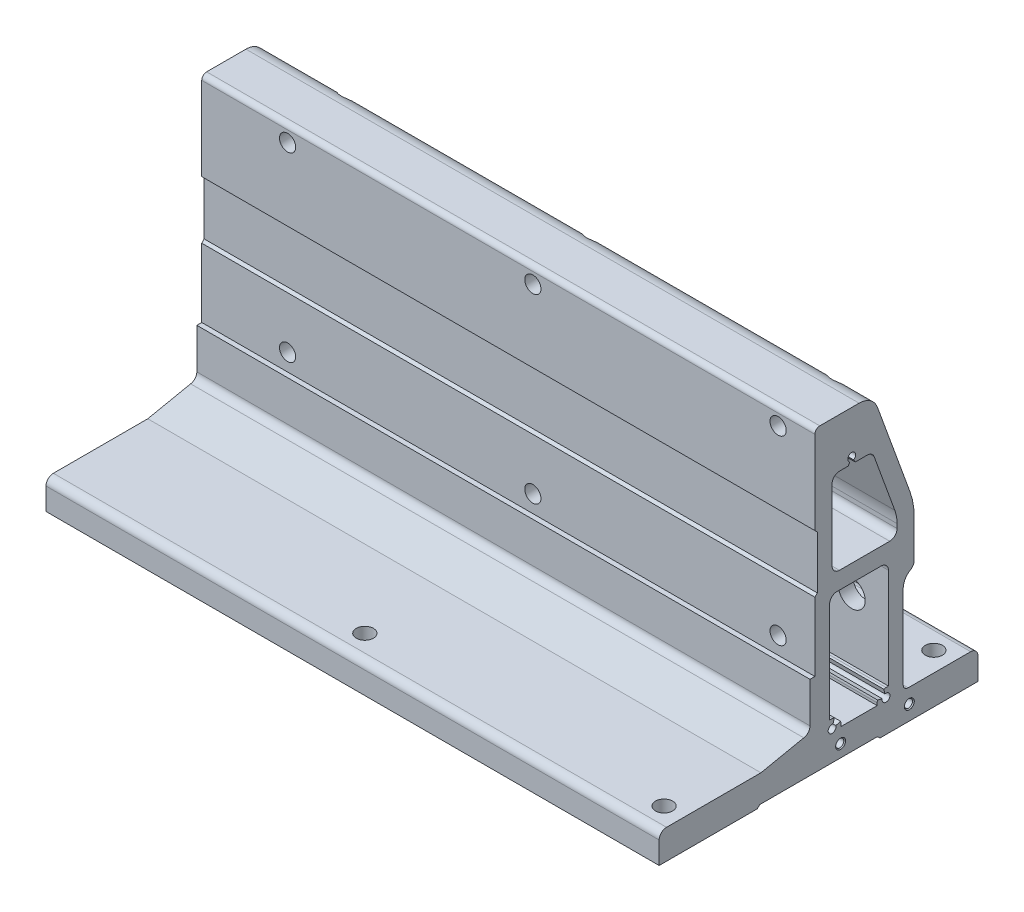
from build123d import *

# Parameters (mm, degrees)
EXTRUDE_1_DEPTH              = 125
HOLE_WIZARD_M6_1_D           = 6.6
HOLE_WIZARD_M6_1_CBORE_D     = 11
HOLE_WIZARD_M6_1_CBORE_DEPTH = 34.5
PATTERN_LINEAR_1_COUNT       = 3
PATTERN_LINEAR_1_PITCH       = 100
HOLE_WIZARD_M4_1_D           = 3.3
HOLE_WIZARD_M4_1_DEPTH       = 10
HOLE_WIZARD_M4_1_CSINK_D     = 4.05
HOLE_WIZARD_M4_1_CSINK_ANGLE = 90
HOLE_WIZARD_M4_1_TIP         = 0.991420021
F_5_0MM_1_D                  = 5
F_5_0MM_1_DEPTH              = 10
F_5_0MM_1_TIP                = 1.502151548
HOLE_WIZARD_7_0_7_1_D        = 7


with BuildPart() as part:
    # Sketch 1 → Extrude 1 (new, symmetric)
    with BuildSketch(Plane(origin=(0, 0, 0), x_dir=(0, 0, -1), z_dir=(1, 0, 0))):
        with BuildLine():
            Line((16.514163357, 121.5), (0.5, 121.5))
            ThreePointArc((0.5, 121.5), (-0.914213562, 120.914213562), (-1.5, 119.5))
            Line((-1.5, 119.5), (-1.5, 85.5))
            Line((-1.5, 85.5), (-0.5, 84.5))
            Line((-0.5, 84.5), (-0.5, 63))
            Line((-0.5, 63), (-1.5, 62))
            Line((-1.5, 62), (-1.5, 34))
            Line((-1.5, 34), (-3.5, 34))
            Line((-3.5, 34), (-3.5, 17.566096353))
            ThreePointArc((-3.5, 17.566096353), (-4.220229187, 15.616059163), (-6.035096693, 14.602337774))
            Line((-6.035096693, 14.602337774), (-23.5, 11))
            Line((-23.5, 11), (-62, 11))
            ThreePointArc((-62, 11), (-64.121320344, 10.121320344), (-65, 8))
            Line((-65, 8), (-65, -1))
            Line((-65, -1), (-25, -1))
            Line((-25, -1), (-24, 0))
            Line((-24, 0), (24, 0))
            Line((24, 0), (25, -1))
            Line((25, -1), (65, -1))
            Line((65, -1), (65, 8))
            ThreePointArc((65, 8), (64.121320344, 10.121320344), (62, 11))
            Line((62, 11), (36.5, 11))
            ThreePointArc((36.5, 11), (35.085786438, 11.585786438), (34.5, 13))
            Line((34.5, 13), (34.5, 47))
            ThreePointArc((34.5, 47), (35.303847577, 50), (37.5, 52.196152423))
            ThreePointArc((37.5, 52.196152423), (38.598076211, 53.294228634), (39, 54.794228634))
            Line((39, 54.794228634), (39, 69.821297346))
            ThreePointArc((39, 69.821297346), (38.54423259, 75.030742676), (37.190778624, 80.081901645))
            Line((37.190778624, 80.081901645), (24.031704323, 116.236161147))
            ThreePointArc((24.031704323, 116.236161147), (21.102774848, 120.053216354), (16.514163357, 121.5))
        make_face()
        with BuildLine():
            Line((25.5, 59.5), (7.5, 59.5))
            ThreePointArc((7.5, 59.5), (5.378679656, 58.621320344), (4.5, 56.5))
            Line((4.5, 56.5), (4.5, 15.6))
            Line((4.5, 15.6), (5.5, 15.6))
            ThreePointArc((5.5, 15.6), (5.969894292, 15.569201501), (6.431748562, 15.477332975))
            Line((6.431748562, 15.477332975), (5.914110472, 13.545481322))
            ThreePointArc((5.914110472, 13.545481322), (4.36862915, 10.86862915), (7.045481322, 12.414110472))
            Line((7.045481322, 12.414110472), (8.977332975, 12.931748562))
            ThreePointArc((8.977332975, 12.931748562), (9.069201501, 12.469894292), (9.1, 12))
            Line((9.1, 12), (9.1, 11))
            Line((9.1, 11), (23.9, 11))
            Line((23.9, 11), (23.9, 12))
            ThreePointArc((23.9, 12), (23.930798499, 12.469894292), (24.022667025, 12.931748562))
            Line((24.022667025, 12.931748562), (25.954518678, 12.414110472))
            ThreePointArc((25.954518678, 12.414110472), (28.63137085, 10.86862915), (27.085889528, 13.545481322))
            Line((27.085889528, 13.545481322), (26.568251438, 15.477332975))
            ThreePointArc((26.568251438, 15.477332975), (27.030105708, 15.569201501), (27.5, 15.6))
            Line((27.5, 15.6), (28.5, 15.6))
            Line((28.5, 15.6), (28.5, 56.5))
            ThreePointArc((28.5, 56.5), (27.621320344, 58.621320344), (25.5, 59.5))
        make_face(mode=Mode.SUBTRACT)
        with BuildLine():
            Line((12.7, 102.614356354), (12.056626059, 101.5))
            Line((12.056626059, 101.5), (8.5, 101.5))
            ThreePointArc((8.5, 101.5), (6.378679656, 100.621320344), (5.5, 98.5))
            Line((5.5, 98.5), (5.5, 69.5))
            ThreePointArc((5.5, 69.5), (6.378679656, 67.378679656), (8.5, 66.5))
            Line((8.5, 66.5), (29, 66.5))
            ThreePointArc((29, 66.5), (31.121320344, 67.378679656), (32, 69.5))
            Line((32, 69.5), (32, 71.231913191))
            ThreePointArc((32, 71.231913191), (31.772116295, 73.836635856), (31.095389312, 76.362215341))
            Line((31.095389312, 76.362215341), (22.664439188, 99.52606043))
            ThreePointArc((22.664439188, 99.52606043), (21.566090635, 100.957456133), (19.845361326, 101.5))
            Line((19.845361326, 101.5), (14.943373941, 101.5))
            Line((14.943373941, 101.5), (14.3, 102.614356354))
            ThreePointArc((14.3, 102.614356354), (13.5, 105.599997), (12.7, 102.614356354))
        make_face(mode=Mode.SUBTRACT)
    extrude(amount=EXTRUDE_1_DEPTH, both=True)

    # Hole Wizard M6 _ _ _ _ _1 (through all)
    with Locations(Plane(origin=(0, 0, -39), x_dir=(-1, 0, 0), z_dir=(0, 0, -1))):
        with Locations((-110, 115), (-110, 41)):
            hole_wizard_m6_1 = CounterBoreHole(HOLE_WIZARD_M6_1_D / 2, HOLE_WIZARD_M6_1_CBORE_D / 2, HOLE_WIZARD_M6_1_CBORE_DEPTH)

    # Pattern Linear 1: Hole Wizard M6 _ _ _ _ _1 ×3
    with Locations(*[(-i * PATTERN_LINEAR_1_PITCH, 0, 0) for i in range(1, PATTERN_LINEAR_1_COUNT)]):
        add(hole_wizard_m6_1, mode=Mode.SUBTRACT)

    # Hole Wizard M4 _ _1
    with Locations(Plane(origin=(125, 0, 0), x_dir=(0, 0, -1), z_dir=(1, 0, 0))):
        with Locations((37, 5), (9, 5)):
            CounterSinkHole(HOLE_WIZARD_M4_1_D / 2, HOLE_WIZARD_M4_1_CSINK_D / 2, depth=HOLE_WIZARD_M4_1_DEPTH, counter_sink_angle=HOLE_WIZARD_M4_1_CSINK_ANGLE)
            with Locations((0, 0, -(HOLE_WIZARD_M4_1_DEPTH + HOLE_WIZARD_M4_1_TIP / 2))):  # 118° drill point
                Cone(0, HOLE_WIZARD_M4_1_D / 2, HOLE_WIZARD_M4_1_TIP, mode=Mode.SUBTRACT)

    # 5.0mm _ _1
    with Locations(Plane(origin=(0, 0, 0), x_dir=(-1, 0, 0), z_dir=(0, -1, 0))):
        with Locations((5, 0), (-117, 0)):
            Hole(F_5_0MM_1_D / 2, depth=F_5_0MM_1_DEPTH)
            with Locations((0, 0, -(F_5_0MM_1_DEPTH + F_5_0MM_1_TIP / 2))):  # 118° drill point
                Cone(0, F_5_0MM_1_D / 2, F_5_0MM_1_TIP, mode=Mode.SUBTRACT)

    # Hole Wizard 7.0 _7_ _ _1 (through all)
    with Locations(Plane(origin=(0, -1, 0), x_dir=(-1, 0, 0), z_dir=(0, -1, 0))):
        with Locations((-117, -55), (5, -55), (5, 55), (-117, 55)):
            Hole(HOLE_WIZARD_7_0_7_1_D / 2)


solid = part.part
